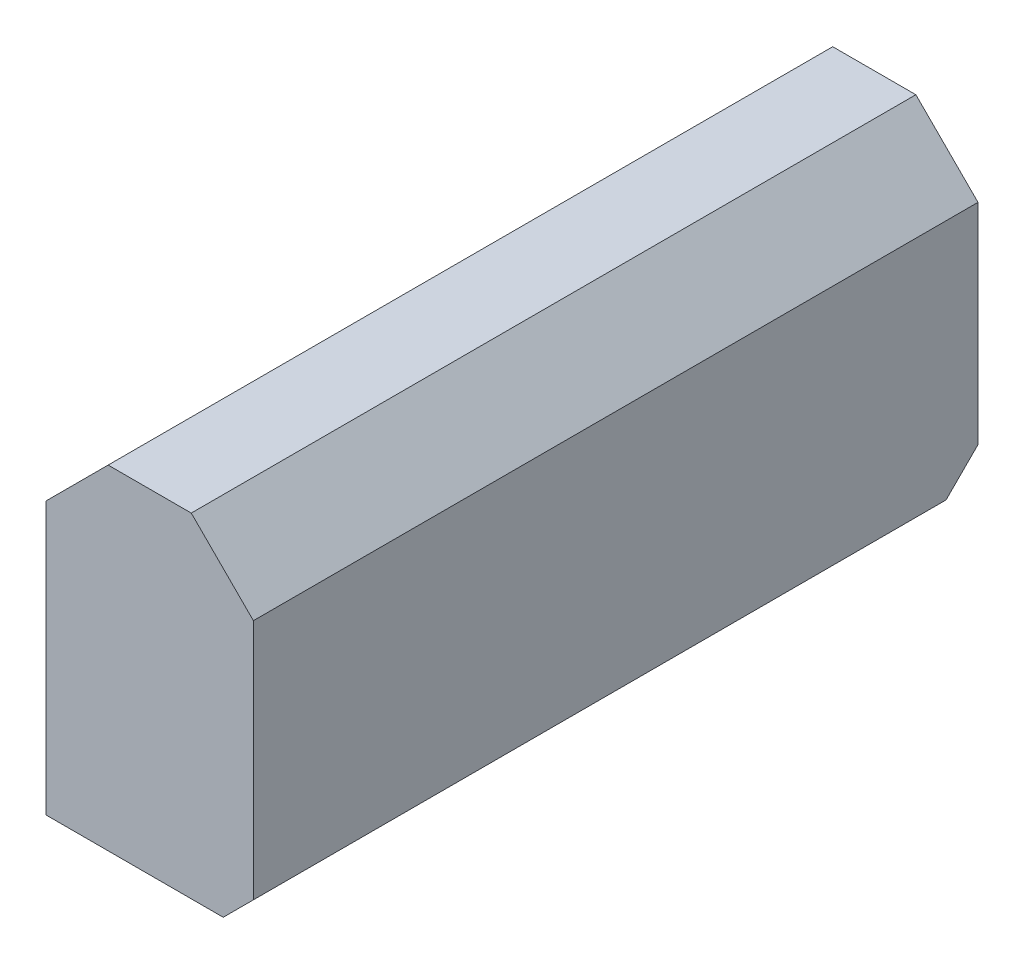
ISO-10303-21;
HEADER;
FILE_DESCRIPTION(('STEP AP214'),'2;1');
FILE_NAME('part.step','',(''),(''),'','','');
FILE_SCHEMA(('AUTOMOTIVE_DESIGN { 1 0 10303 214 1 1 1 1 }'));
ENDSEC;
DATA;
#1=APPLICATION_CONTEXT('core data for automotive mechanical design processes');
#2=APPLICATION_PROTOCOL_DEFINITION('international standard','automotive_design',2000,#1);
#3=PRODUCT_CONTEXT('',#1,'mechanical');
#4=PRODUCT('Part','Part','',(#3));
#5=PRODUCT_RELATED_PRODUCT_CATEGORY('part','',(#4));
#6=PRODUCT_DEFINITION_FORMATION('','',#4);
#7=PRODUCT_DEFINITION_CONTEXT('part definition',#1,'design');
#8=PRODUCT_DEFINITION('design','',#6,#7);
#9=PRODUCT_DEFINITION_SHAPE('','',#8);
#10=(LENGTH_UNIT() NAMED_UNIT(*) SI_UNIT(.MILLI.,.METRE.));
#11=(NAMED_UNIT(*) PLANE_ANGLE_UNIT() SI_UNIT($,.RADIAN.));
#12=(NAMED_UNIT(*) SI_UNIT($,.STERADIAN.) SOLID_ANGLE_UNIT());
#13=UNCERTAINTY_MEASURE_WITH_UNIT(LENGTH_MEASURE(1.E-05),#10,'distance_accuracy_value','');
#14=(GEOMETRIC_REPRESENTATION_CONTEXT(3) GLOBAL_UNCERTAINTY_ASSIGNED_CONTEXT((#13)) GLOBAL_UNIT_ASSIGNED_CONTEXT((#10,
#11,#12)) REPRESENTATION_CONTEXT('',''));
#15=CARTESIAN_POINT('',(0.,0.,0.));
#16=DIRECTION('',(0.,0.,1.));
#17=DIRECTION('',(1.,0.,0.));
#18=AXIS2_PLACEMENT_3D('',#15,#16,#17);
#19=CARTESIAN_POINT('',(-58.42,94.107,204.10347766));
#20=DIRECTION('',(0.,-1.,0.));
#21=DIRECTION('',(1.,0.,0.));
#22=AXIS2_PLACEMENT_3D('',#19,#20,#21);
#23=PLANE('',#22);
#24=DIRECTION('',(-1.,0.,0.));
#25=VECTOR('',#24,1.);
#26=CARTESIAN_POINT('',(-58.42,94.107,-204.10347766));
#27=LINE('',#26,#25);
#28=CARTESIAN_POINT('',(23.4200000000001,94.107,-204.10347766));
#29=VERTEX_POINT('',#28);
#30=CARTESIAN_POINT('',(-23.42,94.107,-204.10347766));
#31=VERTEX_POINT('',#30);
#32=EDGE_CURVE('E149',#29,#31,#27,.T.);
#33=ORIENTED_EDGE('',*,*,#32,.T.);
#34=DIRECTION('',(0.,0.,1.));
#35=VECTOR('',#34,1.);
#36=CARTESIAN_POINT('',(-23.42,94.107,204.10347766));
#37=LINE('',#36,#35);
#38=CARTESIAN_POINT('',(-23.42,94.107,204.10347766));
#39=VERTEX_POINT('',#38);
#40=EDGE_CURVE('E178',#31,#39,#37,.T.);
#41=ORIENTED_EDGE('',*,*,#40,.T.);
#42=DIRECTION('',(-1.,0.,0.));
#43=VECTOR('',#42,1.);
#44=CARTESIAN_POINT('',(-58.42,94.107,204.10347766));
#45=LINE('',#44,#43);
#46=CARTESIAN_POINT('',(23.4200000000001,94.107,204.10347766));
#47=VERTEX_POINT('',#46);
#48=EDGE_CURVE('E127',#47,#39,#45,.T.);
#49=ORIENTED_EDGE('',*,*,#48,.F.);
#50=DIRECTION('',(0.,0.,-1.));
#51=VECTOR('',#50,1.);
#52=CARTESIAN_POINT('',(23.4200000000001,94.107,204.10347766));
#53=LINE('',#52,#51);
#54=EDGE_CURVE('E177',#47,#29,#53,.T.);
#55=ORIENTED_EDGE('',*,*,#54,.T.);
#56=EDGE_LOOP('',(#33,#41,#49,#55));
#57=FACE_BOUND('',#56,.T.);
#58=ADVANCED_FACE('F46',(#57),#23,.F.);
#59=CARTESIAN_POINT('',(-58.42,-94.107,204.10347766));
#60=DIRECTION('',(1.,0.,0.));
#61=DIRECTION('',(0.,0.,-1.));
#62=AXIS2_PLACEMENT_3D('',#59,#60,#61);
#63=PLANE('',#62);
#64=DIRECTION('',(0.,-1.,0.));
#65=VECTOR('',#64,1.);
#66=CARTESIAN_POINT('',(-58.42,-94.107,-204.10347766));
#67=LINE('',#66,#65);
#68=CARTESIAN_POINT('',(-58.42,59.107,-204.10347766));
#69=VERTEX_POINT('',#68);
#70=CARTESIAN_POINT('',(-58.42,-59.1069999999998,-204.10347766));
#71=VERTEX_POINT('',#70);
#72=EDGE_CURVE('E153',#69,#71,#67,.T.);
#73=ORIENTED_EDGE('',*,*,#72,.T.);
#74=DIRECTION('',(0.,0.707106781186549,-0.707106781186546));
#75=VECTOR('',#74,1.);
#76=CARTESIAN_POINT('',(-58.42,-94.107,-169.10347766));
#77=LINE('',#76,#75);
#78=CARTESIAN_POINT('',(-58.42,-94.107,-169.10347766));
#79=VERTEX_POINT('',#78);
#80=EDGE_CURVE('E11',#71,#79,#77,.F.);
#81=ORIENTED_EDGE('',*,*,#80,.T.);
#82=DIRECTION('',(0.,0.,-1.));
#83=VECTOR('',#82,1.);
#84=CARTESIAN_POINT('',(-58.42,-94.107,204.10347766));
#85=LINE('',#84,#83);
#86=CARTESIAN_POINT('',(-58.42,-94.107,204.10347766));
#87=VERTEX_POINT('',#86);
#88=EDGE_CURVE('E129',#87,#79,#85,.T.);
#89=ORIENTED_EDGE('',*,*,#88,.F.);
#90=DIRECTION('',(0.,-1.,0.));
#91=VECTOR('',#90,1.);
#92=CARTESIAN_POINT('',(-58.42,-94.107,204.10347766));
#93=LINE('',#92,#91);
#94=CARTESIAN_POINT('',(-58.42,59.107,204.10347766));
#95=VERTEX_POINT('',#94);
#96=EDGE_CURVE('E114',#95,#87,#93,.T.);
#97=ORIENTED_EDGE('',*,*,#96,.F.);
#98=DIRECTION('',(0.,0.,-1.));
#99=VECTOR('',#98,1.);
#100=CARTESIAN_POINT('',(-58.42,59.107,204.10347766));
#101=LINE('',#100,#99);
#102=EDGE_CURVE('E167',#95,#69,#101,.T.);
#103=ORIENTED_EDGE('',*,*,#102,.T.);
#104=EDGE_LOOP('',(#73,#81,#89,#97,#103));
#105=FACE_BOUND('',#104,.T.);
#106=ADVANCED_FACE('F128',(#105),#63,.F.);
#107=CARTESIAN_POINT('',(-58.42,-94.107,204.10347766));
#108=DIRECTION('',(0.,1.,0.));
#109=DIRECTION('',(-1.,0.,0.));
#110=AXIS2_PLACEMENT_3D('',#107,#108,#109);
#111=PLANE('',#110);
#112=ORIENTED_EDGE('',*,*,#88,.T.);
#113=DIRECTION('',(1.,0.,0.));
#114=VECTOR('',#113,1.);
#115=CARTESIAN_POINT('',(-58.42,-94.107,-169.10347766));
#116=LINE('',#115,#114);
#117=CARTESIAN_POINT('',(41.42,-94.107,-169.10347766));
#118=VERTEX_POINT('',#117);
#119=EDGE_CURVE('E192',#79,#118,#116,.T.);
#120=ORIENTED_EDGE('',*,*,#119,.T.);
#121=DIRECTION('',(0.,0.,1.));
#122=VECTOR('',#121,1.);
#123=CARTESIAN_POINT('',(41.42,-94.107,204.10347766));
#124=LINE('',#123,#122);
#125=CARTESIAN_POINT('',(41.42,-94.107,204.10347766));
#126=VERTEX_POINT('',#125);
#127=EDGE_CURVE('E143',#118,#126,#124,.T.);
#128=ORIENTED_EDGE('',*,*,#127,.T.);
#129=DIRECTION('',(1.,0.,0.));
#130=VECTOR('',#129,1.);
#131=CARTESIAN_POINT('',(-58.42,-94.107,204.10347766));
#132=LINE('',#131,#130);
#133=EDGE_CURVE('E117',#87,#126,#132,.T.);
#134=ORIENTED_EDGE('',*,*,#133,.F.);
#135=EDGE_LOOP('',(#112,#120,#128,#134));
#136=FACE_BOUND('',#135,.T.);
#137=ADVANCED_FACE('F136',(#136),#111,.F.);
#138=CARTESIAN_POINT('',(58.42,-94.107,204.10347766));
#139=DIRECTION('',(-1.,0.,0.));
#140=DIRECTION('',(0.,0.,1.));
#141=AXIS2_PLACEMENT_3D('',#138,#139,#140);
#142=PLANE('',#141);
#143=DIRECTION('',(0.,0.,-1.));
#144=VECTOR('',#143,1.);
#145=CARTESIAN_POINT('',(58.42,-77.107,204.10347766));
#146=LINE('',#145,#144);
#147=CARTESIAN_POINT('',(58.42,-77.107,204.10347766));
#148=VERTEX_POINT('',#147);
#149=CARTESIAN_POINT('',(58.42,-77.107,-186.10347766));
#150=VERTEX_POINT('',#149);
#151=EDGE_CURVE('E137',#148,#150,#146,.T.);
#152=ORIENTED_EDGE('',*,*,#151,.T.);
#153=DIRECTION('',(0.,-0.707106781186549,0.707106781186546));
#154=VECTOR('',#153,1.);
#155=CARTESIAN_POINT('',(58.42,-94.107,-169.10347766));
#156=LINE('',#155,#154);
#157=CARTESIAN_POINT('',(58.42,-59.1069999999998,-204.10347766));
#158=VERTEX_POINT('',#157);
#159=EDGE_CURVE('E68',#150,#158,#156,.F.);
#160=ORIENTED_EDGE('',*,*,#159,.T.);
#161=DIRECTION('',(0.,1.,0.));
#162=VECTOR('',#161,1.);
#163=CARTESIAN_POINT('',(58.42,-94.107,-204.10347766));
#164=LINE('',#163,#162);
#165=CARTESIAN_POINT('',(58.42,59.1069999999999,-204.10347766));
#166=VERTEX_POINT('',#165);
#167=EDGE_CURVE('E156',#158,#166,#164,.T.);
#168=ORIENTED_EDGE('',*,*,#167,.T.);
#169=DIRECTION('',(0.,0.,1.));
#170=VECTOR('',#169,1.);
#171=CARTESIAN_POINT('',(58.42,59.1069999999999,204.10347766));
#172=LINE('',#171,#170);
#173=CARTESIAN_POINT('',(58.42,59.1069999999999,204.10347766));
#174=VERTEX_POINT('',#173);
#175=EDGE_CURVE('E187',#166,#174,#172,.T.);
#176=ORIENTED_EDGE('',*,*,#175,.T.);
#177=DIRECTION('',(0.,1.,0.));
#178=VECTOR('',#177,1.);
#179=CARTESIAN_POINT('',(58.42,-94.107,204.10347766));
#180=LINE('',#179,#178);
#181=EDGE_CURVE('E139',#148,#174,#180,.T.);
#182=ORIENTED_EDGE('',*,*,#181,.F.);
#183=EDGE_LOOP('',(#152,#160,#168,#176,#182));
#184=FACE_BOUND('',#183,.T.);
#185=ADVANCED_FACE('F204',(#184),#142,.F.);
#186=CARTESIAN_POINT('',(0.,0.,204.10347766));
#187=DIRECTION('',(0.,0.,1.));
#188=DIRECTION('',(1.,0.,0.));
#189=AXIS2_PLACEMENT_3D('',#186,#187,#188);
#190=PLANE('',#189);
#191=ORIENTED_EDGE('',*,*,#48,.T.);
#192=DIRECTION('',(0.707106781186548,0.707106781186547,0.));
#193=VECTOR('',#192,1.);
#194=CARTESIAN_POINT('',(-58.7635,58.7635000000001,204.10347766));
#195=LINE('',#194,#193);
#196=EDGE_CURVE('E122',#39,#95,#195,.F.);
#197=ORIENTED_EDGE('',*,*,#196,.T.);
#198=ORIENTED_EDGE('',*,*,#96,.T.);
#199=ORIENTED_EDGE('',*,*,#133,.T.);
#200=DIRECTION('',(-0.707106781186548,-0.707106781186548,0.));
#201=VECTOR('',#200,1.);
#202=CARTESIAN_POINT('',(67.7635,-67.7635,204.10347766));
#203=LINE('',#202,#201);
#204=EDGE_CURVE('E162',#126,#148,#203,.F.);
#205=ORIENTED_EDGE('',*,*,#204,.T.);
#206=ORIENTED_EDGE('',*,*,#181,.T.);
#207=DIRECTION('',(0.707106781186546,-0.707106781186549,0.));
#208=VECTOR('',#207,1.);
#209=CARTESIAN_POINT('',(58.7635000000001,58.7634999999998,204.10347766));
#210=LINE('',#209,#208);
#211=EDGE_CURVE('E181',#174,#47,#210,.F.);
#212=ORIENTED_EDGE('',*,*,#211,.T.);
#213=EDGE_LOOP('',(#191,#197,#198,#199,#205,#206,#212));
#214=FACE_BOUND('',#213,.T.);
#215=ADVANCED_FACE('F118',(#214),#190,.T.);
#216=CARTESIAN_POINT('',(0.,0.,-204.10347766));
#217=DIRECTION('',(0.,0.,1.));
#218=DIRECTION('',(1.,0.,0.));
#219=AXIS2_PLACEMENT_3D('',#216,#217,#218);
#220=PLANE('',#219);
#221=ORIENTED_EDGE('',*,*,#167,.F.);
#222=DIRECTION('',(-1.,0.,0.));
#223=VECTOR('',#222,1.);
#224=CARTESIAN_POINT('',(0.,-59.1069999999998,-204.10347766));
#225=LINE('',#224,#223);
#226=EDGE_CURVE('E57',#158,#71,#225,.T.);
#227=ORIENTED_EDGE('',*,*,#226,.T.);
#228=ORIENTED_EDGE('',*,*,#72,.F.);
#229=DIRECTION('',(-0.707106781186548,-0.707106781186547,0.));
#230=VECTOR('',#229,1.);
#231=CARTESIAN_POINT('',(-58.42,59.107,-204.10347766));
#232=LINE('',#231,#230);
#233=EDGE_CURVE('E172',#69,#31,#232,.F.);
#234=ORIENTED_EDGE('',*,*,#233,.T.);
#235=ORIENTED_EDGE('',*,*,#32,.F.);
#236=DIRECTION('',(-0.707106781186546,0.707106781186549,0.));
#237=VECTOR('',#236,1.);
#238=CARTESIAN_POINT('',(23.4200000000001,94.107,-204.10347766));
#239=LINE('',#238,#237);
#240=EDGE_CURVE('E166',#29,#166,#239,.F.);
#241=ORIENTED_EDGE('',*,*,#240,.T.);
#242=EDGE_LOOP('',(#221,#227,#228,#234,#235,#241));
#243=FACE_BOUND('',#242,.T.);
#244=ADVANCED_FACE('F227',(#243),#220,.F.);
#245=CARTESIAN_POINT('',(58.42,-77.107,204.10347766));
#246=DIRECTION('',(-0.707106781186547,0.707106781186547,0.));
#247=DIRECTION('',(0.,0.,-1.));
#248=AXIS2_PLACEMENT_3D('',#245,#246,#247);
#249=PLANE('',#248);
#250=ORIENTED_EDGE('',*,*,#127,.F.);
#251=DIRECTION('',(0.577350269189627,0.577350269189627,-0.577350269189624));
#252=VECTOR('',#251,1.);
#253=CARTESIAN_POINT('',(-71.6489851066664,-207.175985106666,-56.0344925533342));
#254=LINE('',#253,#252);
#255=EDGE_CURVE('E191',#118,#150,#254,.T.);
#256=ORIENTED_EDGE('',*,*,#255,.T.);
#257=ORIENTED_EDGE('',*,*,#151,.F.);
#258=ORIENTED_EDGE('',*,*,#204,.F.);
#259=EDGE_LOOP('',(#250,#256,#257,#258));
#260=FACE_BOUND('',#259,.T.);
#261=ADVANCED_FACE('F203',(#260),#249,.F.);
#262=CARTESIAN_POINT('',(-58.42,59.107,204.10347766));
#263=DIRECTION('',(0.707106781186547,-0.707106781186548,0.));
#264=DIRECTION('',(0.,0.,-1.));
#265=AXIS2_PLACEMENT_3D('',#262,#263,#264);
#266=PLANE('',#265);
#267=ORIENTED_EDGE('',*,*,#196,.F.);
#268=ORIENTED_EDGE('',*,*,#40,.F.);
#269=ORIENTED_EDGE('',*,*,#233,.F.);
#270=ORIENTED_EDGE('',*,*,#102,.F.);
#271=EDGE_LOOP('',(#267,#268,#269,#270));
#272=FACE_BOUND('',#271,.T.);
#273=ADVANCED_FACE('F211',(#272),#266,.F.);
#274=CARTESIAN_POINT('',(23.4200000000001,94.107,204.10347766));
#275=DIRECTION('',(-0.707106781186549,-0.707106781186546,0.));
#276=DIRECTION('',(0.,0.,-1.));
#277=AXIS2_PLACEMENT_3D('',#274,#275,#276);
#278=PLANE('',#277);
#279=ORIENTED_EDGE('',*,*,#211,.F.);
#280=ORIENTED_EDGE('',*,*,#175,.F.);
#281=ORIENTED_EDGE('',*,*,#240,.F.);
#282=ORIENTED_EDGE('',*,*,#54,.F.);
#283=EDGE_LOOP('',(#279,#280,#281,#282));
#284=FACE_BOUND('',#283,.T.);
#285=ADVANCED_FACE('F206',(#284),#278,.F.);
#286=CARTESIAN_POINT('',(-58.42,-94.107,-169.10347766));
#287=DIRECTION('',(0.,0.707106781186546,0.707106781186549));
#288=DIRECTION('',(1.,0.,0.));
#289=AXIS2_PLACEMENT_3D('',#286,#287,#288);
#290=PLANE('',#289);
#291=ORIENTED_EDGE('',*,*,#80,.F.);
#292=ORIENTED_EDGE('',*,*,#226,.F.);
#293=ORIENTED_EDGE('',*,*,#159,.F.);
#294=ORIENTED_EDGE('',*,*,#255,.F.);
#295=ORIENTED_EDGE('',*,*,#119,.F.);
#296=EDGE_LOOP('',(#291,#292,#293,#294,#295));
#297=FACE_BOUND('',#296,.T.);
#298=ADVANCED_FACE('F47',(#297),#290,.F.);
#299=CLOSED_SHELL('',(#58,#106,#137,#185,#215,#244,#261,#273,#285,#298));
#300=MANIFOLD_SOLID_BREP('B2',#299);
#301=ADVANCED_BREP_SHAPE_REPRESENTATION('',(#18,#300),#14);
#302=SHAPE_DEFINITION_REPRESENTATION(#9,#301);
ENDSEC;
END-ISO-10303-21;
